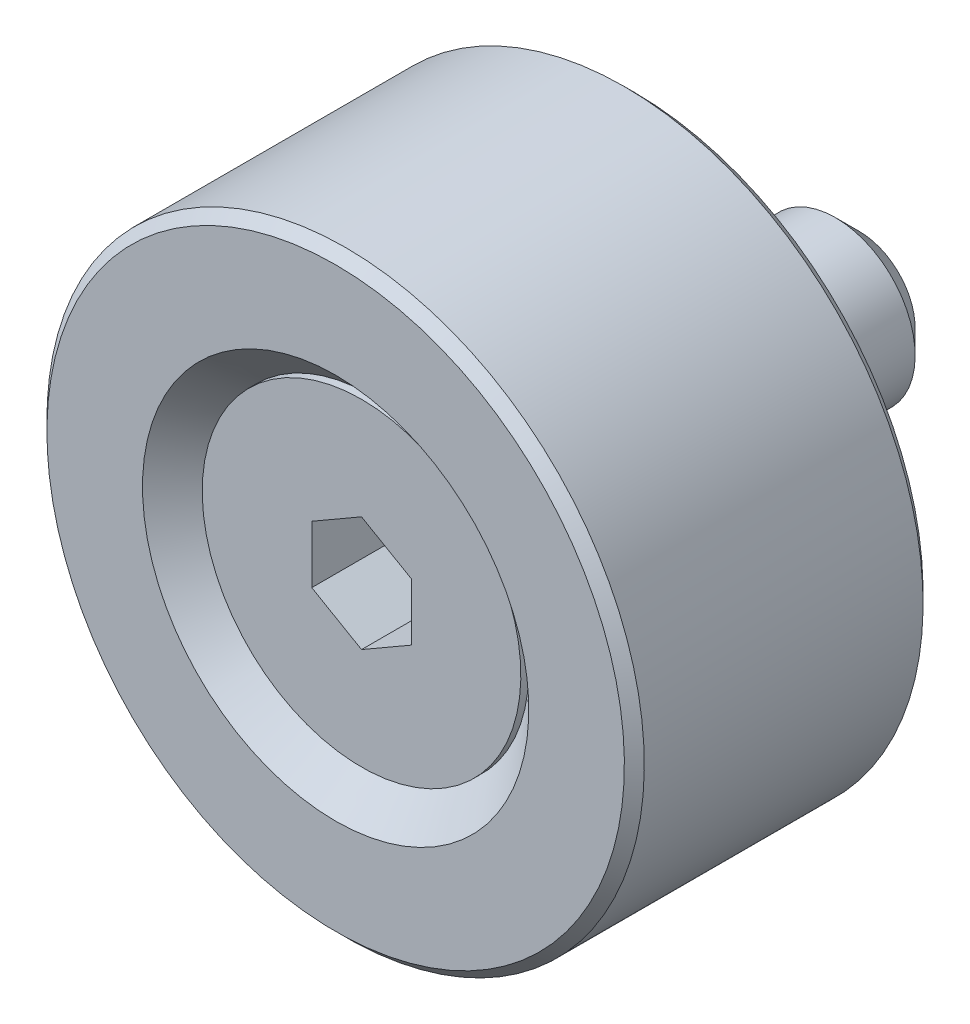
ISO-10303-21;
HEADER;
FILE_DESCRIPTION(('STEP AP214'),'2;1');
FILE_NAME('part.step','',(''),(''),'','','');
FILE_SCHEMA(('AUTOMOTIVE_DESIGN { 1 0 10303 214 1 1 1 1 }'));
ENDSEC;
DATA;
#1=APPLICATION_CONTEXT('core data for automotive mechanical design processes');
#2=APPLICATION_PROTOCOL_DEFINITION('international standard','automotive_design',2000,#1);
#3=PRODUCT_CONTEXT('',#1,'mechanical');
#4=PRODUCT('Part','Part','',(#3));
#5=PRODUCT_RELATED_PRODUCT_CATEGORY('part','',(#4));
#6=PRODUCT_DEFINITION_FORMATION('','',#4);
#7=PRODUCT_DEFINITION_CONTEXT('part definition',#1,'design');
#8=PRODUCT_DEFINITION('design','',#6,#7);
#9=PRODUCT_DEFINITION_SHAPE('','',#8);
#10=(LENGTH_UNIT() NAMED_UNIT(*) SI_UNIT(.MILLI.,.METRE.));
#11=(NAMED_UNIT(*) PLANE_ANGLE_UNIT() SI_UNIT($,.RADIAN.));
#12=(NAMED_UNIT(*) SI_UNIT($,.STERADIAN.) SOLID_ANGLE_UNIT());
#13=UNCERTAINTY_MEASURE_WITH_UNIT(LENGTH_MEASURE(1.E-05),#10,'distance_accuracy_value','');
#14=(GEOMETRIC_REPRESENTATION_CONTEXT(3) GLOBAL_UNCERTAINTY_ASSIGNED_CONTEXT((#13)) GLOBAL_UNIT_ASSIGNED_CONTEXT((#10,
#11,#12)) REPRESENTATION_CONTEXT('',''));
#15=CARTESIAN_POINT('',(0.,0.,0.));
#16=DIRECTION('',(0.,0.,1.));
#17=DIRECTION('',(1.,0.,0.));
#18=AXIS2_PLACEMENT_3D('',#15,#16,#17);
#19=CARTESIAN_POINT('',(0.,4.74999999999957,0.));
#20=DIRECTION('',(0.,0.,1.));
#21=DIRECTION('',(0.,-1.,0.));
#22=AXIS2_PLACEMENT_3D('',#19,#20,#21);
#23=PLANE('',#22);
#24=CARTESIAN_POINT('',(0.,0.,0.));
#25=DIRECTION('',(0.,0.,-1.));
#26=DIRECTION('',(0.,1.,0.));
#27=AXIS2_PLACEMENT_3D('',#24,#25,#26);
#28=CIRCLE('',#27,4.74999999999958);
#29=CARTESIAN_POINT('',(0.,4.74999999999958,0.));
#30=VERTEX_POINT('',#29);
#31=EDGE_CURVE('E115',#30,#30,#28,.T.);
#32=ORIENTED_EDGE('',*,*,#31,.F.);
#33=EDGE_LOOP('',(#32));
#34=FACE_BOUND('',#33,.T.);
#35=CARTESIAN_POINT('',(0.,0.,-1.80411241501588E-13));
#36=DIRECTION('',(0.,0.,-1.));
#37=DIRECTION('',(0.,1.,0.));
#38=AXIS2_PLACEMENT_3D('',#35,#36,#37);
#39=CIRCLE('',#38,14.5000000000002);
#40=CARTESIAN_POINT('',(0.,14.5000000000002,0.));
#41=VERTEX_POINT('',#40);
#42=EDGE_CURVE('E9',#41,#41,#39,.T.);
#43=ORIENTED_EDGE('',*,*,#42,.T.);
#44=EDGE_LOOP('',(#43));
#45=FACE_BOUND('',#44,.T.);
#46=ADVANCED_FACE('F14',(#34,#45),#23,.F.);
#47=CARTESIAN_POINT('',(0.,0.,0.499999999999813));
#48=DIRECTION('',(0.,0.,1.));
#49=DIRECTION('',(0.,-1.,0.));
#50=AXIS2_PLACEMENT_3D('',#47,#48,#49);
#51=CONICAL_SURFACE('',#50,15.,0.78539816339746);
#52=ORIENTED_EDGE('',*,*,#42,.F.);
#53=EDGE_LOOP('',(#52));
#54=FACE_BOUND('',#53,.T.);
#55=CARTESIAN_POINT('',(0.,0.,0.499999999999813));
#56=DIRECTION('',(0.,0.,-1.));
#57=DIRECTION('',(0.,1.,0.));
#58=AXIS2_PLACEMENT_3D('',#55,#56,#57);
#59=CIRCLE('',#58,15.);
#60=CARTESIAN_POINT('',(0.,15.,0.499999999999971));
#61=VERTEX_POINT('',#60);
#62=EDGE_CURVE('E21',#61,#61,#59,.T.);
#63=ORIENTED_EDGE('',*,*,#62,.T.);
#64=EDGE_LOOP('',(#63));
#65=FACE_BOUND('',#64,.T.);
#66=ADVANCED_FACE('F155',(#54,#65),#51,.T.);
#67=CARTESIAN_POINT('',(0.,2.08166817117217E-13,-20.));
#68=DIRECTION('',(0.,0.,-1.));
#69=DIRECTION('',(0.,1.,0.));
#70=AXIS2_PLACEMENT_3D('',#67,#68,#69);
#71=CYLINDRICAL_SURFACE('',#70,15.0000000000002);
#72=ORIENTED_EDGE('',*,*,#62,.F.);
#73=EDGE_LOOP('',(#72));
#74=FACE_BOUND('',#73,.T.);
#75=CARTESIAN_POINT('',(0.,-1.55978516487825E-13,14.4999999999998));
#76=DIRECTION('',(0.,0.,-1.));
#77=DIRECTION('',(0.,1.,0.));
#78=AXIS2_PLACEMENT_3D('',#75,#76,#77);
#79=CIRCLE('',#78,15.0000000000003);
#80=CARTESIAN_POINT('',(0.,15.0000000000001,14.5));
#81=VERTEX_POINT('',#80);
#82=EDGE_CURVE('E150',#81,#81,#79,.T.);
#83=ORIENTED_EDGE('',*,*,#82,.T.);
#84=EDGE_LOOP('',(#83));
#85=FACE_BOUND('',#84,.T.);
#86=ADVANCED_FACE('F157',(#74,#85),#71,.T.);
#87=CARTESIAN_POINT('',(0.,-1.61255985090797E-13,14.9999999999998));
#88=DIRECTION('',(0.,0.,-1.));
#89=DIRECTION('',(0.,1.,0.));
#90=AXIS2_PLACEMENT_3D('',#87,#88,#89);
#91=CONICAL_SURFACE('',#90,14.5000000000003,0.785398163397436);
#92=ORIENTED_EDGE('',*,*,#82,.F.);
#93=EDGE_LOOP('',(#92));
#94=FACE_BOUND('',#93,.T.);
#95=CARTESIAN_POINT('',(0.,-1.61255985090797E-13,14.9999999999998));
#96=DIRECTION('',(0.,0.,-1.));
#97=DIRECTION('',(0.,1.,0.));
#98=AXIS2_PLACEMENT_3D('',#95,#96,#97);
#99=CIRCLE('',#98,14.5000000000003);
#100=CARTESIAN_POINT('',(0.,14.5000000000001,15.));
#101=VERTEX_POINT('',#100);
#102=EDGE_CURVE('E147',#101,#101,#99,.T.);
#103=ORIENTED_EDGE('',*,*,#102,.T.);
#104=EDGE_LOOP('',(#103));
#105=FACE_BOUND('',#104,.T.);
#106=ADVANCED_FACE('F160',(#94,#105),#91,.T.);
#107=CARTESIAN_POINT('',(0.,14.5000000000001,15.));
#108=DIRECTION('',(0.,0.,-1.));
#109=DIRECTION('',(0.,1.,0.));
#110=AXIS2_PLACEMENT_3D('',#107,#108,#109);
#111=PLANE('',#110);
#112=ORIENTED_EDGE('',*,*,#102,.F.);
#113=EDGE_LOOP('',(#112));
#114=FACE_BOUND('',#113,.T.);
#115=CARTESIAN_POINT('',(0.,-1.61255985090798E-13,14.9999999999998));
#116=DIRECTION('',(0.,0.,-1.));
#117=DIRECTION('',(0.,1.,0.));
#118=AXIS2_PLACEMENT_3D('',#115,#116,#117);
#119=CIRCLE('',#118,9.70000000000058);
#120=CARTESIAN_POINT('',(0.,9.70000000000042,14.9999999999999));
#121=VERTEX_POINT('',#120);
#122=EDGE_CURVE('E144',#121,#121,#119,.T.);
#123=ORIENTED_EDGE('',*,*,#122,.T.);
#124=EDGE_LOOP('',(#123));
#125=FACE_BOUND('',#124,.T.);
#126=ADVANCED_FACE('F166',(#114,#125),#111,.F.);
#127=CARTESIAN_POINT('',(0.,-1.43312591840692E-13,13.2999999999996));
#128=DIRECTION('',(0.,0.,1.));
#129=DIRECTION('',(0.,-1.,0.));
#130=AXIS2_PLACEMENT_3D('',#127,#128,#129);
#131=CONICAL_SURFACE('',#130,8.00000000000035,0.785398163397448);
#132=ORIENTED_EDGE('',*,*,#122,.F.);
#133=EDGE_LOOP('',(#132));
#134=FACE_BOUND('',#133,.T.);
#135=CARTESIAN_POINT('',(0.,-1.43312591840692E-13,13.2999999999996));
#136=DIRECTION('',(0.,0.,-1.));
#137=DIRECTION('',(0.,1.,0.));
#138=AXIS2_PLACEMENT_3D('',#135,#136,#137);
#139=CIRCLE('',#138,8.00000000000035);
#140=CARTESIAN_POINT('',(0.,8.00000000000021,13.2999999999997));
#141=VERTEX_POINT('',#140);
#142=EDGE_CURVE('E141',#141,#141,#139,.T.);
#143=ORIENTED_EDGE('',*,*,#142,.T.);
#144=EDGE_LOOP('',(#143));
#145=FACE_BOUND('',#144,.T.);
#146=ADVANCED_FACE('F172',(#134,#145),#131,.F.);
#147=CARTESIAN_POINT('',(0.,2.08166817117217E-13,-20.));
#148=DIRECTION('',(0.,0.,-1.));
#149=DIRECTION('',(0.,1.,0.));
#150=AXIS2_PLACEMENT_3D('',#147,#148,#149);
#151=CYLINDRICAL_SURFACE('',#150,8.00000000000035);
#152=ORIENTED_EDGE('',*,*,#142,.F.);
#153=EDGE_LOOP('',(#152));
#154=FACE_BOUND('',#153,.T.);
#155=CARTESIAN_POINT('',(0.,-1.47534566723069E-13,13.6999999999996));
#156=DIRECTION('',(0.,0.,-1.));
#157=DIRECTION('',(0.,1.,0.));
#158=AXIS2_PLACEMENT_3D('',#155,#156,#157);
#159=CIRCLE('',#158,8.00000000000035);
#160=CARTESIAN_POINT('',(0.,8.0000000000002,13.6999999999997));
#161=VERTEX_POINT('',#160);
#162=EDGE_CURVE('E138',#161,#161,#159,.T.);
#163=ORIENTED_EDGE('',*,*,#162,.T.);
#164=EDGE_LOOP('',(#163));
#165=FACE_BOUND('',#164,.T.);
#166=ADVANCED_FACE('F178',(#154,#165),#151,.T.);
#167=CARTESIAN_POINT('',(0.,1.38777878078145E-13,13.6999999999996));
#168=DIRECTION('',(0.,0.,-1.));
#169=DIRECTION('',(0.,1.,0.));
#170=AXIS2_PLACEMENT_3D('',#167,#168,#169);
#171=PLANE('',#170);
#172=DIRECTION('',(-0.866025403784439,-0.5,0.));
#173=VECTOR('',#172,1.);
#174=CARTESIAN_POINT('',(0.,2.88675134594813,13.6999999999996));
#175=LINE('',#174,#173);
#176=CARTESIAN_POINT('',(0.,2.88675134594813,13.6999999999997));
#177=VERTEX_POINT('',#176);
#178=CARTESIAN_POINT('',(-2.5,1.44337567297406,13.6999999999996));
#179=VERTEX_POINT('',#178);
#180=EDGE_CURVE('E102',#177,#179,#175,.T.);
#181=ORIENTED_EDGE('',*,*,#180,.F.);
#182=DIRECTION('',(-0.866025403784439,0.5,0.));
#183=VECTOR('',#182,1.);
#184=CARTESIAN_POINT('',(2.5,1.44337567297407,13.6999999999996));
#185=LINE('',#184,#183);
#186=CARTESIAN_POINT('',(2.5,1.44337567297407,13.6999999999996));
#187=VERTEX_POINT('',#186);
#188=EDGE_CURVE('E28',#187,#177,#185,.T.);
#189=ORIENTED_EDGE('',*,*,#188,.F.);
#190=DIRECTION('',(0.,1.,0.));
#191=VECTOR('',#190,1.);
#192=CARTESIAN_POINT('',(2.5,-1.44337567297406,13.6999999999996));
#193=LINE('',#192,#191);
#194=CARTESIAN_POINT('',(2.5,-1.44337567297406,13.6999999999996));
#195=VERTEX_POINT('',#194);
#196=EDGE_CURVE('E111',#195,#187,#193,.T.);
#197=ORIENTED_EDGE('',*,*,#196,.F.);
#198=DIRECTION('',(0.866025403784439,0.5,0.));
#199=VECTOR('',#198,1.);
#200=CARTESIAN_POINT('',(0.,-2.88675134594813,13.6999999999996));
#201=LINE('',#200,#199);
#202=CARTESIAN_POINT('',(0.,-2.88675134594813,13.6999999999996));
#203=VERTEX_POINT('',#202);
#204=EDGE_CURVE('E109',#203,#195,#201,.T.);
#205=ORIENTED_EDGE('',*,*,#204,.F.);
#206=DIRECTION('',(0.866025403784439,-0.5,0.));
#207=VECTOR('',#206,1.);
#208=CARTESIAN_POINT('',(-2.5,-1.44337567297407,13.6999999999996));
#209=LINE('',#208,#207);
#210=CARTESIAN_POINT('',(-2.5,-1.44337567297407,13.6999999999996));
#211=VERTEX_POINT('',#210);
#212=EDGE_CURVE('E76',#211,#203,#209,.T.);
#213=ORIENTED_EDGE('',*,*,#212,.F.);
#214=DIRECTION('',(0.,-1.,0.));
#215=VECTOR('',#214,1.);
#216=CARTESIAN_POINT('',(-2.5,1.44337567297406,13.6999999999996));
#217=LINE('',#216,#215);
#218=EDGE_CURVE('E105',#179,#211,#217,.T.);
#219=ORIENTED_EDGE('',*,*,#218,.F.);
#220=EDGE_LOOP('',(#181,#189,#197,#205,#213,#219));
#221=FACE_BOUND('',#220,.T.);
#222=ORIENTED_EDGE('',*,*,#162,.F.);
#223=EDGE_LOOP('',(#222));
#224=FACE_BOUND('',#223,.T.);
#225=ADVANCED_FACE('F184',(#221,#224),#171,.F.);
#226=CARTESIAN_POINT('',(0.,2.80000000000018,-11.3000000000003));
#227=DIRECTION('',(0.,0.,1.));
#228=DIRECTION('',(0.,-1.,0.));
#229=AXIS2_PLACEMENT_3D('',#226,#227,#228);
#230=PLANE('',#229);
#231=CARTESIAN_POINT('',(0.,1.16338863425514E-13,-11.3000000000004));
#232=DIRECTION('',(0.,0.,-1.));
#233=DIRECTION('',(0.,1.,0.));
#234=AXIS2_PLACEMENT_3D('',#231,#232,#233);
#235=CIRCLE('',#234,2.80000000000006);
#236=CARTESIAN_POINT('',(0.,2.80000000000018,-11.3000000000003));
#237=VERTEX_POINT('',#236);
#238=EDGE_CURVE('E135',#237,#237,#235,.T.);
#239=ORIENTED_EDGE('',*,*,#238,.T.);
#240=EDGE_LOOP('',(#239));
#241=FACE_BOUND('',#240,.T.);
#242=ADVANCED_FACE('F189',(#241),#230,.F.);
#243=CARTESIAN_POINT('',(0.,1.03672938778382E-13,-10.1000000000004));
#244=DIRECTION('',(0.,0.,1.));
#245=DIRECTION('',(0.,-1.,0.));
#246=AXIS2_PLACEMENT_3D('',#243,#244,#245);
#247=CONICAL_SURFACE('',#246,4.00000000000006,0.785398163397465);
#248=ORIENTED_EDGE('',*,*,#238,.F.);
#249=EDGE_LOOP('',(#248));
#250=FACE_BOUND('',#249,.T.);
#251=CARTESIAN_POINT('',(0.,1.03672938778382E-13,-10.1000000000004));
#252=DIRECTION('',(0.,0.,-1.));
#253=DIRECTION('',(0.,1.,0.));
#254=AXIS2_PLACEMENT_3D('',#251,#252,#253);
#255=CIRCLE('',#254,4.00000000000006);
#256=CARTESIAN_POINT('',(0.,4.00000000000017,-10.1000000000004));
#257=VERTEX_POINT('',#256);
#258=EDGE_CURVE('E132',#257,#257,#255,.T.);
#259=ORIENTED_EDGE('',*,*,#258,.T.);
#260=EDGE_LOOP('',(#259));
#261=FACE_BOUND('',#260,.T.);
#262=ADVANCED_FACE('F196',(#250,#261),#247,.T.);
#263=CARTESIAN_POINT('',(0.,2.08166817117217E-13,-20.));
#264=DIRECTION('',(0.,0.,-1.));
#265=DIRECTION('',(0.,1.,0.));
#266=AXIS2_PLACEMENT_3D('',#263,#264,#265);
#267=CYLINDRICAL_SURFACE('',#266,4.0000000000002);
#268=ORIENTED_EDGE('',*,*,#258,.F.);
#269=EDGE_LOOP('',(#268));
#270=FACE_BOUND('',#269,.T.);
#271=CARTESIAN_POINT('',(0.,-1.01092843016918E-13,9.29999999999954));
#272=DIRECTION('',(0.,0.,-1.));
#273=DIRECTION('',(0.,1.,0.));
#274=AXIS2_PLACEMENT_3D('',#271,#272,#273);
#275=CIRCLE('',#274,4.00000000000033);
#276=CARTESIAN_POINT('',(0.,4.00000000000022,9.29999999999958));
#277=VERTEX_POINT('',#276);
#278=EDGE_CURVE('E129',#277,#277,#275,.T.);
#279=ORIENTED_EDGE('',*,*,#278,.T.);
#280=EDGE_LOOP('',(#279));
#281=FACE_BOUND('',#280,.T.);
#282=ADVANCED_FACE('F230',(#270,#281),#267,.T.);
#283=CARTESIAN_POINT('',(0.,-1.03731577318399E-13,9.54999999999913));
#284=DIRECTION('',(0.,0.,1.));
#285=DIRECTION('',(0.,-1.,0.));
#286=AXIS2_PLACEMENT_3D('',#283,#284,#285);
#287=CONICAL_SURFACE('',#286,4.24999999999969,0.785398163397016);
#288=ORIENTED_EDGE('',*,*,#278,.F.);
#289=EDGE_LOOP('',(#288));
#290=FACE_BOUND('',#289,.T.);
#291=CARTESIAN_POINT('',(0.,-1.03731577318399E-13,9.54999999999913));
#292=DIRECTION('',(0.,0.,-1.));
#293=DIRECTION('',(0.,1.,0.));
#294=AXIS2_PLACEMENT_3D('',#291,#292,#293);
#295=CIRCLE('',#294,4.24999999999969);
#296=CARTESIAN_POINT('',(0.,4.24999999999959,9.54999999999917));
#297=VERTEX_POINT('',#296);
#298=EDGE_CURVE('E126',#297,#297,#295,.T.);
#299=ORIENTED_EDGE('',*,*,#298,.T.);
#300=EDGE_LOOP('',(#299));
#301=FACE_BOUND('',#300,.T.);
#302=ADVANCED_FACE('F222',(#290,#301),#287,.T.);
#303=CARTESIAN_POINT('',(0.,2.08166817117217E-13,-20.));
#304=DIRECTION('',(0.,0.,-1.));
#305=DIRECTION('',(0.,1.,0.));
#306=AXIS2_PLACEMENT_3D('',#303,#304,#305);
#307=CYLINDRICAL_SURFACE('',#306,4.24999999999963);
#308=ORIENTED_EDGE('',*,*,#298,.F.);
#309=EDGE_LOOP('',(#308));
#310=FACE_BOUND('',#309,.T.);
#311=CARTESIAN_POINT('',(0.,0.,0.499999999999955));
#312=DIRECTION('',(0.,0.,-1.));
#313=DIRECTION('',(0.,1.,0.));
#314=AXIS2_PLACEMENT_3D('',#311,#312,#313);
#315=CIRCLE('',#314,4.24999999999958);
#316=CARTESIAN_POINT('',(0.,4.24999999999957,0.5));
#317=VERTEX_POINT('',#316);
#318=EDGE_CURVE('E123',#317,#317,#315,.T.);
#319=ORIENTED_EDGE('',*,*,#318,.T.);
#320=EDGE_LOOP('',(#319));
#321=FACE_BOUND('',#320,.T.);
#322=ADVANCED_FACE('F213',(#310,#321),#307,.F.);
#323=CARTESIAN_POINT('',(0.,0.,0.));
#324=DIRECTION('',(0.,0.,-1.));
#325=DIRECTION('',(0.,1.,0.));
#326=AXIS2_PLACEMENT_3D('',#323,#324,#325);
#327=CONICAL_SURFACE('',#326,4.74999999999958,0.785398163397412);
#328=ORIENTED_EDGE('',*,*,#318,.F.);
#329=EDGE_LOOP('',(#328));
#330=FACE_BOUND('',#329,.T.);
#331=ORIENTED_EDGE('',*,*,#31,.T.);
#332=EDGE_LOOP('',(#331));
#333=FACE_BOUND('',#332,.T.);
#334=ADVANCED_FACE('F210',(#330,#333),#327,.F.);
#335=CARTESIAN_POINT('',(2.5,1.44337567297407,9.69999999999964));
#336=DIRECTION('',(0.5,0.866025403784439,0.));
#337=DIRECTION('',(-0.866025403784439,0.5,0.));
#338=AXIS2_PLACEMENT_3D('',#335,#336,#337);
#339=PLANE('',#338);
#340=ORIENTED_EDGE('',*,*,#188,.T.);
#341=DIRECTION('',(0.,0.,1.));
#342=VECTOR('',#341,1.);
#343=CARTESIAN_POINT('',(0.,2.88675134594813,9.69999999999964));
#344=LINE('',#343,#342);
#345=CARTESIAN_POINT('',(0.,2.88675134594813,9.69999999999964));
#346=VERTEX_POINT('',#345);
#347=EDGE_CURVE('E58',#346,#177,#344,.T.);
#348=ORIENTED_EDGE('',*,*,#347,.F.);
#349=DIRECTION('',(-0.866025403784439,0.5,0.));
#350=VECTOR('',#349,1.);
#351=CARTESIAN_POINT('',(2.5,1.44337567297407,9.69999999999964));
#352=LINE('',#351,#350);
#353=CARTESIAN_POINT('',(2.5,1.44337567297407,9.69999999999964));
#354=VERTEX_POINT('',#353);
#355=EDGE_CURVE('E113',#354,#346,#352,.T.);
#356=ORIENTED_EDGE('',*,*,#355,.F.);
#357=DIRECTION('',(0.,0.,1.));
#358=VECTOR('',#357,1.);
#359=CARTESIAN_POINT('',(2.5,1.44337567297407,9.69999999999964));
#360=LINE('',#359,#358);
#361=EDGE_CURVE('E36',#354,#187,#360,.T.);
#362=ORIENTED_EDGE('',*,*,#361,.T.);
#363=EDGE_LOOP('',(#340,#348,#356,#362));
#364=FACE_BOUND('',#363,.T.);
#365=ADVANCED_FACE('F212',(#364),#339,.F.);
#366=CARTESIAN_POINT('',(2.5,-1.44337567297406,9.69999999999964));
#367=DIRECTION('',(1.,0.,0.));
#368=DIRECTION('',(0.,0.,-1.));
#369=AXIS2_PLACEMENT_3D('',#366,#367,#368);
#370=PLANE('',#369);
#371=ORIENTED_EDGE('',*,*,#196,.T.);
#372=ORIENTED_EDGE('',*,*,#361,.F.);
#373=DIRECTION('',(0.,1.,0.));
#374=VECTOR('',#373,1.);
#375=CARTESIAN_POINT('',(2.5,-1.44337567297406,9.69999999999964));
#376=LINE('',#375,#374);
#377=CARTESIAN_POINT('',(2.5,-1.44337567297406,9.69999999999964));
#378=VERTEX_POINT('',#377);
#379=EDGE_CURVE('E88',#378,#354,#376,.T.);
#380=ORIENTED_EDGE('',*,*,#379,.F.);
#381=DIRECTION('',(0.,0.,1.));
#382=VECTOR('',#381,1.);
#383=CARTESIAN_POINT('',(2.5,-1.44337567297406,9.69999999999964));
#384=LINE('',#383,#382);
#385=EDGE_CURVE('E80',#378,#195,#384,.T.);
#386=ORIENTED_EDGE('',*,*,#385,.T.);
#387=EDGE_LOOP('',(#371,#372,#380,#386));
#388=FACE_BOUND('',#387,.T.);
#389=ADVANCED_FACE('F220',(#388),#370,.F.);
#390=CARTESIAN_POINT('',(0.,-2.88675134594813,9.69999999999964));
#391=DIRECTION('',(0.5,-0.866025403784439,0.));
#392=DIRECTION('',(0.866025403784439,0.5,0.));
#393=AXIS2_PLACEMENT_3D('',#390,#391,#392);
#394=PLANE('',#393);
#395=ORIENTED_EDGE('',*,*,#204,.T.);
#396=ORIENTED_EDGE('',*,*,#385,.F.);
#397=DIRECTION('',(0.866025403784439,0.5,0.));
#398=VECTOR('',#397,1.);
#399=CARTESIAN_POINT('',(0.,-2.88675134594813,9.69999999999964));
#400=LINE('',#399,#398);
#401=CARTESIAN_POINT('',(0.,-2.88675134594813,9.69999999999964));
#402=VERTEX_POINT('',#401);
#403=EDGE_CURVE('E84',#402,#378,#400,.T.);
#404=ORIENTED_EDGE('',*,*,#403,.F.);
#405=DIRECTION('',(0.,0.,1.));
#406=VECTOR('',#405,1.);
#407=CARTESIAN_POINT('',(0.,-2.88675134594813,9.69999999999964));
#408=LINE('',#407,#406);
#409=EDGE_CURVE('E69',#402,#203,#408,.T.);
#410=ORIENTED_EDGE('',*,*,#409,.T.);
#411=EDGE_LOOP('',(#395,#396,#404,#410));
#412=FACE_BOUND('',#411,.T.);
#413=ADVANCED_FACE('F85',(#412),#394,.F.);
#414=CARTESIAN_POINT('',(-2.5,-1.44337567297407,9.69999999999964));
#415=DIRECTION('',(-0.5,-0.866025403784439,0.));
#416=DIRECTION('',(0.866025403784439,-0.5,0.));
#417=AXIS2_PLACEMENT_3D('',#414,#415,#416);
#418=PLANE('',#417);
#419=ORIENTED_EDGE('',*,*,#212,.T.);
#420=ORIENTED_EDGE('',*,*,#409,.F.);
#421=DIRECTION('',(0.866025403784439,-0.5,0.));
#422=VECTOR('',#421,1.);
#423=CARTESIAN_POINT('',(-2.5,-1.44337567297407,9.69999999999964));
#424=LINE('',#423,#422);
#425=CARTESIAN_POINT('',(-2.5,-1.44337567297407,9.69999999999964));
#426=VERTEX_POINT('',#425);
#427=EDGE_CURVE('E73',#426,#402,#424,.T.);
#428=ORIENTED_EDGE('',*,*,#427,.F.);
#429=DIRECTION('',(0.,0.,1.));
#430=VECTOR('',#429,1.);
#431=CARTESIAN_POINT('',(-2.5,-1.44337567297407,9.69999999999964));
#432=LINE('',#431,#430);
#433=EDGE_CURVE('E81',#426,#211,#432,.T.);
#434=ORIENTED_EDGE('',*,*,#433,.T.);
#435=EDGE_LOOP('',(#419,#420,#428,#434));
#436=FACE_BOUND('',#435,.T.);
#437=ADVANCED_FACE('F71',(#436),#418,.F.);
#438=CARTESIAN_POINT('',(-2.5,1.44337567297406,9.69999999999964));
#439=DIRECTION('',(-1.,0.,0.));
#440=DIRECTION('',(0.,-1.,0.));
#441=AXIS2_PLACEMENT_3D('',#438,#439,#440);
#442=PLANE('',#441);
#443=ORIENTED_EDGE('',*,*,#218,.T.);
#444=ORIENTED_EDGE('',*,*,#433,.F.);
#445=DIRECTION('',(0.,-1.,0.));
#446=VECTOR('',#445,1.);
#447=CARTESIAN_POINT('',(-2.5,1.44337567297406,9.69999999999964));
#448=LINE('',#447,#446);
#449=CARTESIAN_POINT('',(-2.5,1.44337567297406,9.69999999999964));
#450=VERTEX_POINT('',#449);
#451=EDGE_CURVE('E94',#450,#426,#448,.T.);
#452=ORIENTED_EDGE('',*,*,#451,.F.);
#453=DIRECTION('',(0.,0.,1.));
#454=VECTOR('',#453,1.);
#455=CARTESIAN_POINT('',(-2.5,1.44337567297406,9.69999999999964));
#456=LINE('',#455,#454);
#457=EDGE_CURVE('E118',#450,#179,#456,.T.);
#458=ORIENTED_EDGE('',*,*,#457,.T.);
#459=EDGE_LOOP('',(#443,#444,#452,#458));
#460=FACE_BOUND('',#459,.T.);
#461=ADVANCED_FACE('F306',(#460),#442,.F.);
#462=CARTESIAN_POINT('',(0.,2.88675134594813,9.69999999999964));
#463=DIRECTION('',(-0.5,0.866025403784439,0.));
#464=DIRECTION('',(-0.866025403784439,-0.5,0.));
#465=AXIS2_PLACEMENT_3D('',#462,#463,#464);
#466=PLANE('',#465);
#467=ORIENTED_EDGE('',*,*,#180,.T.);
#468=ORIENTED_EDGE('',*,*,#457,.F.);
#469=DIRECTION('',(-0.866025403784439,-0.5,0.));
#470=VECTOR('',#469,1.);
#471=CARTESIAN_POINT('',(0.,2.88675134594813,9.69999999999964));
#472=LINE('',#471,#470);
#473=EDGE_CURVE('E96',#346,#450,#472,.T.);
#474=ORIENTED_EDGE('',*,*,#473,.F.);
#475=ORIENTED_EDGE('',*,*,#347,.T.);
#476=EDGE_LOOP('',(#467,#468,#474,#475));
#477=FACE_BOUND('',#476,.T.);
#478=ADVANCED_FACE('F315',(#477),#466,.F.);
#479=CARTESIAN_POINT('',(0.,2.88675134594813,9.69999999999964));
#480=DIRECTION('',(0.,0.,1.));
#481=DIRECTION('',(1.,0.,0.));
#482=AXIS2_PLACEMENT_3D('',#479,#480,#481);
#483=PLANE('',#482);
#484=ORIENTED_EDGE('',*,*,#355,.T.);
#485=ORIENTED_EDGE('',*,*,#473,.T.);
#486=ORIENTED_EDGE('',*,*,#451,.T.);
#487=ORIENTED_EDGE('',*,*,#427,.T.);
#488=ORIENTED_EDGE('',*,*,#403,.T.);
#489=ORIENTED_EDGE('',*,*,#379,.T.);
#490=EDGE_LOOP('',(#484,#485,#486,#487,#488,#489));
#491=FACE_BOUND('',#490,.T.);
#492=ADVANCED_FACE('F91',(#491),#483,.T.);
#493=CLOSED_SHELL('',(#46,#66,#86,#106,#126,#146,#166,#225,#242,#262,#282,#302,#322,#334,#365,
#389,#413,#437,#461,#478,#492));
#494=MANIFOLD_SOLID_BREP('B1',#493);
#495=ADVANCED_BREP_SHAPE_REPRESENTATION('',(#18,#494),#14);
#496=SHAPE_DEFINITION_REPRESENTATION(#9,#495);
ENDSEC;
END-ISO-10303-21;
